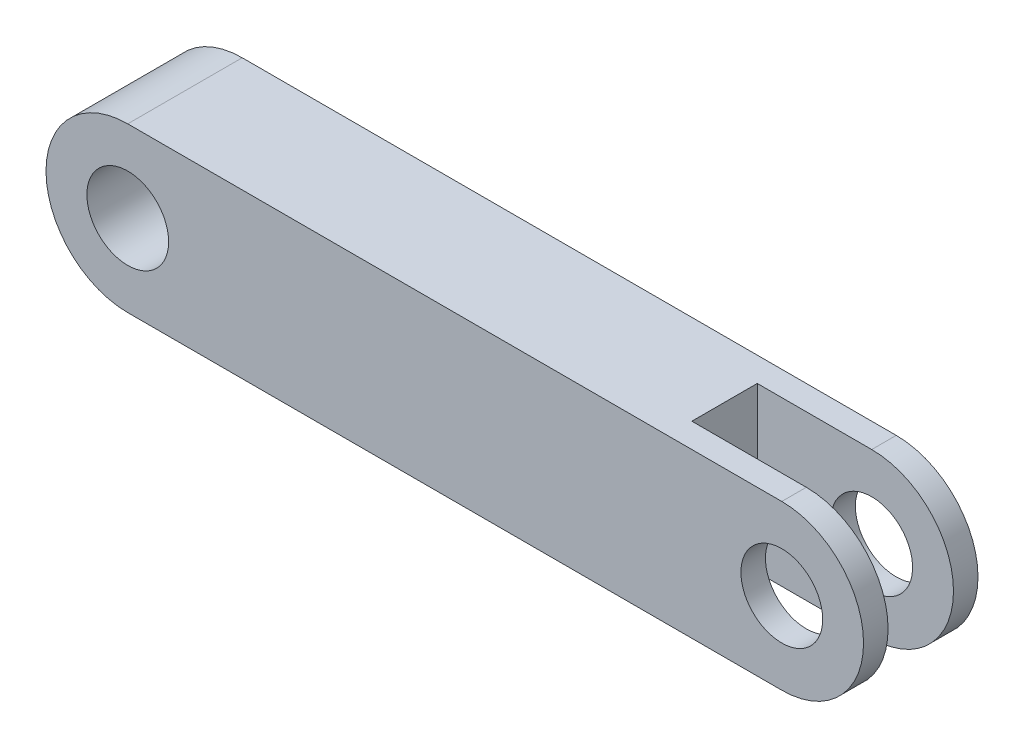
ISO-10303-21;
HEADER;
FILE_DESCRIPTION(('STEP AP214'),'2;1');
FILE_NAME('part.step','',(''),(''),'','','');
FILE_SCHEMA(('AUTOMOTIVE_DESIGN { 1 0 10303 214 1 1 1 1 }'));
ENDSEC;
DATA;
#1=APPLICATION_CONTEXT('core data for automotive mechanical design processes');
#2=APPLICATION_PROTOCOL_DEFINITION('international standard','automotive_design',2000,#1);
#3=PRODUCT_CONTEXT('',#1,'mechanical');
#4=PRODUCT('Part','Part','',(#3));
#5=PRODUCT_RELATED_PRODUCT_CATEGORY('part','',(#4));
#6=PRODUCT_DEFINITION_FORMATION('','',#4);
#7=PRODUCT_DEFINITION_CONTEXT('part definition',#1,'design');
#8=PRODUCT_DEFINITION('design','',#6,#7);
#9=PRODUCT_DEFINITION_SHAPE('','',#8);
#10=(LENGTH_UNIT() NAMED_UNIT(*) SI_UNIT(.MILLI.,.METRE.));
#11=(NAMED_UNIT(*) PLANE_ANGLE_UNIT() SI_UNIT($,.RADIAN.));
#12=(NAMED_UNIT(*) SI_UNIT($,.STERADIAN.) SOLID_ANGLE_UNIT());
#13=UNCERTAINTY_MEASURE_WITH_UNIT(LENGTH_MEASURE(1.E-05),#10,'distance_accuracy_value','');
#14=(GEOMETRIC_REPRESENTATION_CONTEXT(3) GLOBAL_UNCERTAINTY_ASSIGNED_CONTEXT((#13)) GLOBAL_UNIT_ASSIGNED_CONTEXT((#10,
#11,#12)) REPRESENTATION_CONTEXT('',''));
#15=CARTESIAN_POINT('',(0.,0.,0.));
#16=DIRECTION('',(0.,0.,1.));
#17=DIRECTION('',(1.,0.,0.));
#18=AXIS2_PLACEMENT_3D('',#15,#16,#17);
#19=CARTESIAN_POINT('',(40.,-5.,3.5));
#20=DIRECTION('',(0.,0.,-1.));
#21=DIRECTION('',(-1.,0.,0.));
#22=AXIS2_PLACEMENT_3D('',#19,#20,#21);
#23=CYLINDRICAL_SURFACE('',#22,5.);
#24=DIRECTION('',(0.,0.,-1.));
#25=VECTOR('',#24,1.);
#26=CARTESIAN_POINT('',(40.,-9.99999999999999,3.5));
#27=LINE('',#26,#25);
#28=CARTESIAN_POINT('',(40.,-9.99999999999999,3.5));
#29=VERTEX_POINT('',#28);
#30=CARTESIAN_POINT('',(40.,-9.99999999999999,2.));
#31=VERTEX_POINT('',#30);
#32=EDGE_CURVE('E41',#29,#31,#27,.T.);
#33=ORIENTED_EDGE('',*,*,#32,.T.);
#34=CARTESIAN_POINT('',(40.,-5.,2.));
#35=DIRECTION('',(0.,0.,1.));
#36=DIRECTION('',(1.,0.,0.));
#37=AXIS2_PLACEMENT_3D('',#34,#35,#36);
#38=CIRCLE('',#37,5.);
#39=CARTESIAN_POINT('',(40.,0.,2.));
#40=VERTEX_POINT('',#39);
#41=EDGE_CURVE('E103',#40,#31,#38,.F.);
#42=ORIENTED_EDGE('',*,*,#41,.F.);
#43=DIRECTION('',(0.,0.,-1.));
#44=VECTOR('',#43,1.);
#45=CARTESIAN_POINT('',(40.,0.,3.5));
#46=LINE('',#45,#44);
#47=CARTESIAN_POINT('',(40.,0.,3.5));
#48=VERTEX_POINT('',#47);
#49=EDGE_CURVE('E117',#48,#40,#46,.T.);
#50=ORIENTED_EDGE('',*,*,#49,.F.);
#51=CARTESIAN_POINT('',(40.,-5.,3.5));
#52=DIRECTION('',(0.,0.,1.));
#53=DIRECTION('',(-1.,0.,0.));
#54=AXIS2_PLACEMENT_3D('',#51,#52,#53);
#55=CIRCLE('',#54,5.);
#56=EDGE_CURVE('E130',#29,#48,#55,.T.);
#57=ORIENTED_EDGE('',*,*,#56,.F.);
#58=EDGE_LOOP('',(#33,#42,#50,#57));
#59=FACE_BOUND('',#58,.T.);
#60=ADVANCED_FACE('F33',(#59),#23,.T.);
#61=CARTESIAN_POINT('',(40.,-5.,3.5));
#62=DIRECTION('',(0.,0.,-1.));
#63=DIRECTION('',(-1.,0.,0.));
#64=AXIS2_PLACEMENT_3D('',#61,#62,#63);
#65=CYLINDRICAL_SURFACE('',#64,2.5);
#66=CARTESIAN_POINT('',(40.,-5.,2.));
#67=DIRECTION('',(0.,0.,1.));
#68=DIRECTION('',(1.,0.,0.));
#69=AXIS2_PLACEMENT_3D('',#66,#67,#68);
#70=CIRCLE('',#69,2.5);
#71=CARTESIAN_POINT('',(42.5,-5.,2.));
#72=VERTEX_POINT('',#71);
#73=EDGE_CURVE('E163',#72,#72,#70,.F.);
#74=ORIENTED_EDGE('',*,*,#73,.T.);
#75=EDGE_LOOP('',(#74));
#76=FACE_BOUND('',#75,.T.);
#77=CARTESIAN_POINT('',(40.,-5.,3.5));
#78=DIRECTION('',(0.,0.,1.));
#79=DIRECTION('',(1.,0.,0.));
#80=AXIS2_PLACEMENT_3D('',#77,#78,#79);
#81=CIRCLE('',#80,2.5);
#82=CARTESIAN_POINT('',(42.5,-5.,3.5));
#83=VERTEX_POINT('',#82);
#84=EDGE_CURVE('E153',#83,#83,#81,.T.);
#85=ORIENTED_EDGE('',*,*,#84,.T.);
#86=EDGE_LOOP('',(#85));
#87=FACE_BOUND('',#86,.T.);
#88=ADVANCED_FACE('F178',(#76,#87),#65,.F.);
#89=CARTESIAN_POINT('',(0.,-5.,3.5));
#90=DIRECTION('',(0.,0.,-1.));
#91=DIRECTION('',(-1.,0.,0.));
#92=AXIS2_PLACEMENT_3D('',#89,#90,#91);
#93=PLANE('',#92);
#94=CARTESIAN_POINT('',(0.,-5.,3.5));
#95=DIRECTION('',(0.,0.,1.));
#96=DIRECTION('',(1.,0.,0.));
#97=AXIS2_PLACEMENT_3D('',#94,#95,#96);
#98=CIRCLE('',#97,2.5);
#99=CARTESIAN_POINT('',(2.5,-5.,3.5));
#100=VERTEX_POINT('',#99);
#101=EDGE_CURVE('E147',#100,#100,#98,.T.);
#102=ORIENTED_EDGE('',*,*,#101,.F.);
#103=EDGE_LOOP('',(#102));
#104=FACE_BOUND('',#103,.T.);
#105=CARTESIAN_POINT('',(0.,-5.,3.5));
#106=DIRECTION('',(0.,0.,1.));
#107=DIRECTION('',(-1.,0.,0.));
#108=AXIS2_PLACEMENT_3D('',#105,#106,#107);
#109=CIRCLE('',#108,5.);
#110=CARTESIAN_POINT('',(0.,0.,3.5));
#111=VERTEX_POINT('',#110);
#112=CARTESIAN_POINT('',(0.,-10.,3.5));
#113=VERTEX_POINT('',#112);
#114=EDGE_CURVE('E134',#111,#113,#109,.T.);
#115=ORIENTED_EDGE('',*,*,#114,.T.);
#116=DIRECTION('',(1.,0.,0.));
#117=VECTOR('',#116,1.);
#118=CARTESIAN_POINT('',(40.,-9.99999999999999,3.5));
#119=LINE('',#118,#117);
#120=EDGE_CURVE('E132',#113,#29,#119,.T.);
#121=ORIENTED_EDGE('',*,*,#120,.T.);
#122=ORIENTED_EDGE('',*,*,#56,.T.);
#123=DIRECTION('',(-1.,0.,0.));
#124=VECTOR('',#123,1.);
#125=CARTESIAN_POINT('',(0.,0.,3.5));
#126=LINE('',#125,#124);
#127=EDGE_CURVE('E56',#48,#111,#126,.T.);
#128=ORIENTED_EDGE('',*,*,#127,.T.);
#129=EDGE_LOOP('',(#115,#121,#122,#128));
#130=FACE_BOUND('',#129,.T.);
#131=ORIENTED_EDGE('',*,*,#84,.F.);
#132=EDGE_LOOP('',(#131));
#133=FACE_BOUND('',#132,.T.);
#134=ADVANCED_FACE('F201',(#104,#130,#133),#93,.F.);
#135=CARTESIAN_POINT('',(0.,-5.,-3.5));
#136=DIRECTION('',(0.,0.,-1.));
#137=DIRECTION('',(-1.,0.,0.));
#138=AXIS2_PLACEMENT_3D('',#135,#136,#137);
#139=PLANE('',#138);
#140=CARTESIAN_POINT('',(0.,-5.,-3.5));
#141=DIRECTION('',(0.,0.,1.));
#142=DIRECTION('',(1.,0.,0.));
#143=AXIS2_PLACEMENT_3D('',#140,#141,#142);
#144=CIRCLE('',#143,2.5);
#145=CARTESIAN_POINT('',(2.5,-5.,-3.5));
#146=VERTEX_POINT('',#145);
#147=EDGE_CURVE('E150',#146,#146,#144,.T.);
#148=ORIENTED_EDGE('',*,*,#147,.T.);
#149=EDGE_LOOP('',(#148));
#150=FACE_BOUND('',#149,.T.);
#151=CARTESIAN_POINT('',(0.,-5.,-3.5));
#152=DIRECTION('',(0.,0.,1.));
#153=DIRECTION('',(-1.,0.,0.));
#154=AXIS2_PLACEMENT_3D('',#151,#152,#153);
#155=CIRCLE('',#154,5.);
#156=CARTESIAN_POINT('',(0.,0.,-3.5));
#157=VERTEX_POINT('',#156);
#158=CARTESIAN_POINT('',(0.,-10.,-3.5));
#159=VERTEX_POINT('',#158);
#160=EDGE_CURVE('E144',#157,#159,#155,.T.);
#161=ORIENTED_EDGE('',*,*,#160,.F.);
#162=DIRECTION('',(-1.,0.,0.));
#163=VECTOR('',#162,1.);
#164=CARTESIAN_POINT('',(0.,0.,-3.5));
#165=LINE('',#164,#163);
#166=CARTESIAN_POINT('',(40.,0.,-3.5));
#167=VERTEX_POINT('',#166);
#168=EDGE_CURVE('E136',#167,#157,#165,.T.);
#169=ORIENTED_EDGE('',*,*,#168,.F.);
#170=CARTESIAN_POINT('',(40.,-5.,-3.5));
#171=DIRECTION('',(0.,0.,1.));
#172=DIRECTION('',(-1.,0.,0.));
#173=AXIS2_PLACEMENT_3D('',#170,#171,#172);
#174=CIRCLE('',#173,5.);
#175=CARTESIAN_POINT('',(40.,-9.99999999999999,-3.5));
#176=VERTEX_POINT('',#175);
#177=EDGE_CURVE('E138',#176,#167,#174,.T.);
#178=ORIENTED_EDGE('',*,*,#177,.F.);
#179=DIRECTION('',(1.,0.,0.));
#180=VECTOR('',#179,1.);
#181=CARTESIAN_POINT('',(40.,-9.99999999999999,-3.5));
#182=LINE('',#181,#180);
#183=EDGE_CURVE('E141',#159,#176,#182,.T.);
#184=ORIENTED_EDGE('',*,*,#183,.F.);
#185=EDGE_LOOP('',(#161,#169,#178,#184));
#186=FACE_BOUND('',#185,.T.);
#187=CARTESIAN_POINT('',(40.,-5.,-3.5));
#188=DIRECTION('',(0.,0.,1.));
#189=DIRECTION('',(1.,0.,0.));
#190=AXIS2_PLACEMENT_3D('',#187,#188,#189);
#191=CIRCLE('',#190,2.5);
#192=CARTESIAN_POINT('',(42.5,-5.,-3.5));
#193=VERTEX_POINT('',#192);
#194=EDGE_CURVE('E156',#193,#193,#191,.T.);
#195=ORIENTED_EDGE('',*,*,#194,.T.);
#196=EDGE_LOOP('',(#195));
#197=FACE_BOUND('',#196,.T.);
#198=ADVANCED_FACE('F220',(#150,#186,#197),#139,.T.);
#199=CARTESIAN_POINT('',(0.,-5.,3.5));
#200=DIRECTION('',(0.,0.,-1.));
#201=DIRECTION('',(-1.,0.,0.));
#202=AXIS2_PLACEMENT_3D('',#199,#200,#201);
#203=CYLINDRICAL_SURFACE('',#202,5.);
#204=ORIENTED_EDGE('',*,*,#160,.T.);
#205=DIRECTION('',(0.,0.,-1.));
#206=VECTOR('',#205,1.);
#207=CARTESIAN_POINT('',(0.,-10.,3.5));
#208=LINE('',#207,#206);
#209=EDGE_CURVE('E11',#113,#159,#208,.T.);
#210=ORIENTED_EDGE('',*,*,#209,.F.);
#211=ORIENTED_EDGE('',*,*,#114,.F.);
#212=DIRECTION('',(0.,0.,-1.));
#213=VECTOR('',#212,1.);
#214=CARTESIAN_POINT('',(0.,0.,3.5));
#215=LINE('',#214,#213);
#216=EDGE_CURVE('E125',#111,#157,#215,.T.);
#217=ORIENTED_EDGE('',*,*,#216,.T.);
#218=EDGE_LOOP('',(#204,#210,#211,#217));
#219=FACE_BOUND('',#218,.T.);
#220=ADVANCED_FACE('F35',(#219),#203,.T.);
#221=CARTESIAN_POINT('',(40.,-9.99999999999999,3.5));
#222=DIRECTION('',(0.,1.,0.));
#223=DIRECTION('',(-1.,0.,0.));
#224=AXIS2_PLACEMENT_3D('',#221,#222,#223);
#225=PLANE('',#224);
#226=DIRECTION('',(0.,0.,-1.));
#227=VECTOR('',#226,1.);
#228=CARTESIAN_POINT('',(33.,-9.99999999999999,-2.));
#229=LINE('',#228,#227);
#230=CARTESIAN_POINT('',(33.,-9.99999999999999,2.));
#231=VERTEX_POINT('',#230);
#232=CARTESIAN_POINT('',(33.,-9.99999999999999,-2.));
#233=VERTEX_POINT('',#232);
#234=EDGE_CURVE('E171',#231,#233,#229,.T.);
#235=ORIENTED_EDGE('',*,*,#234,.F.);
#236=DIRECTION('',(-1.,0.,0.));
#237=VECTOR('',#236,1.);
#238=CARTESIAN_POINT('',(45.,-9.99999999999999,2.));
#239=LINE('',#238,#237);
#240=EDGE_CURVE('E169',#31,#231,#239,.T.);
#241=ORIENTED_EDGE('',*,*,#240,.F.);
#242=ORIENTED_EDGE('',*,*,#32,.F.);
#243=ORIENTED_EDGE('',*,*,#120,.F.);
#244=ORIENTED_EDGE('',*,*,#209,.T.);
#245=ORIENTED_EDGE('',*,*,#183,.T.);
#246=CARTESIAN_POINT('',(40.,-9.99999999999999,-2.));
#247=VERTEX_POINT('',#246);
#248=EDGE_CURVE('E122',#247,#176,#27,.T.);
#249=ORIENTED_EDGE('',*,*,#248,.F.);
#250=DIRECTION('',(1.,0.,0.));
#251=VECTOR('',#250,1.);
#252=CARTESIAN_POINT('',(45.,-9.99999999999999,-2.));
#253=LINE('',#252,#251);
#254=EDGE_CURVE('E159',#233,#247,#253,.T.);
#255=ORIENTED_EDGE('',*,*,#254,.F.);
#256=EDGE_LOOP('',(#235,#241,#242,#243,#244,#245,#249,#255));
#257=FACE_BOUND('',#256,.T.);
#258=ADVANCED_FACE('F204',(#257),#225,.F.);
#259=CARTESIAN_POINT('',(40.,0.,-2.));
#260=VERTEX_POINT('',#259);
#261=EDGE_CURVE('E123',#260,#167,#46,.T.);
#262=ORIENTED_EDGE('',*,*,#261,.F.);
#263=CARTESIAN_POINT('',(40.,-5.,-2.));
#264=DIRECTION('',(0.,0.,-1.));
#265=DIRECTION('',(-1.,0.,0.));
#266=AXIS2_PLACEMENT_3D('',#263,#264,#265);
#267=CIRCLE('',#266,5.);
#268=EDGE_CURVE('E48',#247,#260,#267,.F.);
#269=ORIENTED_EDGE('',*,*,#268,.F.);
#270=ORIENTED_EDGE('',*,*,#248,.T.);
#271=ORIENTED_EDGE('',*,*,#177,.T.);
#272=EDGE_LOOP('',(#262,#269,#270,#271));
#273=FACE_BOUND('',#272,.T.);
#274=ADVANCED_FACE('F197',(#273),#23,.T.);
#275=CARTESIAN_POINT('',(0.,0.,3.5));
#276=DIRECTION('',(0.,-1.,0.));
#277=DIRECTION('',(0.,0.,-1.));
#278=AXIS2_PLACEMENT_3D('',#275,#276,#277);
#279=PLANE('',#278);
#280=ORIENTED_EDGE('',*,*,#49,.T.);
#281=DIRECTION('',(1.,0.,0.));
#282=VECTOR('',#281,1.);
#283=CARTESIAN_POINT('',(45.,0.,2.));
#284=LINE('',#283,#282);
#285=CARTESIAN_POINT('',(33.,0.,2.));
#286=VERTEX_POINT('',#285);
#287=EDGE_CURVE('E99',#286,#40,#284,.T.);
#288=ORIENTED_EDGE('',*,*,#287,.F.);
#289=DIRECTION('',(0.,0.,1.));
#290=VECTOR('',#289,1.);
#291=CARTESIAN_POINT('',(33.,0.,-2.));
#292=LINE('',#291,#290);
#293=CARTESIAN_POINT('',(33.,0.,-2.));
#294=VERTEX_POINT('',#293);
#295=EDGE_CURVE('E111',#294,#286,#292,.T.);
#296=ORIENTED_EDGE('',*,*,#295,.F.);
#297=DIRECTION('',(-1.,0.,0.));
#298=VECTOR('',#297,1.);
#299=CARTESIAN_POINT('',(45.,0.,-2.));
#300=LINE('',#299,#298);
#301=EDGE_CURVE('E167',#260,#294,#300,.T.);
#302=ORIENTED_EDGE('',*,*,#301,.F.);
#303=ORIENTED_EDGE('',*,*,#261,.T.);
#304=ORIENTED_EDGE('',*,*,#168,.T.);
#305=ORIENTED_EDGE('',*,*,#216,.F.);
#306=ORIENTED_EDGE('',*,*,#127,.F.);
#307=EDGE_LOOP('',(#280,#288,#296,#302,#303,#304,#305,#306));
#308=FACE_BOUND('',#307,.T.);
#309=ADVANCED_FACE('F121',(#308),#279,.F.);
#310=CARTESIAN_POINT('',(0.,-5.,3.5));
#311=DIRECTION('',(0.,0.,-1.));
#312=DIRECTION('',(-1.,0.,0.));
#313=AXIS2_PLACEMENT_3D('',#310,#311,#312);
#314=CYLINDRICAL_SURFACE('',#313,2.5);
#315=ORIENTED_EDGE('',*,*,#101,.T.);
#316=EDGE_LOOP('',(#315));
#317=FACE_BOUND('',#316,.T.);
#318=ORIENTED_EDGE('',*,*,#147,.F.);
#319=EDGE_LOOP('',(#318));
#320=FACE_BOUND('',#319,.T.);
#321=ADVANCED_FACE('F192',(#317,#320),#314,.F.);
#322=CARTESIAN_POINT('',(40.,-5.,-2.));
#323=DIRECTION('',(0.,0.,-1.));
#324=DIRECTION('',(-1.,0.,0.));
#325=AXIS2_PLACEMENT_3D('',#322,#323,#324);
#326=CIRCLE('',#325,2.5);
#327=CARTESIAN_POINT('',(37.5,-5.,-2.));
#328=VERTEX_POINT('',#327);
#329=EDGE_CURVE('E119',#328,#328,#326,.F.);
#330=ORIENTED_EDGE('',*,*,#329,.T.);
#331=EDGE_LOOP('',(#330));
#332=FACE_BOUND('',#331,.T.);
#333=ORIENTED_EDGE('',*,*,#194,.F.);
#334=EDGE_LOOP('',(#333));
#335=FACE_BOUND('',#334,.T.);
#336=ADVANCED_FACE('F183',(#332,#335),#65,.F.);
#337=CARTESIAN_POINT('',(45.,-10.001,2.));
#338=DIRECTION('',(0.,0.,1.));
#339=DIRECTION('',(1.,0.,0.));
#340=AXIS2_PLACEMENT_3D('',#337,#338,#339);
#341=PLANE('',#340);
#342=ORIENTED_EDGE('',*,*,#73,.F.);
#343=EDGE_LOOP('',(#342));
#344=FACE_BOUND('',#343,.T.);
#345=ORIENTED_EDGE('',*,*,#240,.T.);
#346=DIRECTION('',(0.,1.,0.));
#347=VECTOR('',#346,1.);
#348=CARTESIAN_POINT('',(33.,-10.001,2.));
#349=LINE('',#348,#347);
#350=EDGE_CURVE('E105',#231,#286,#349,.T.);
#351=ORIENTED_EDGE('',*,*,#350,.T.);
#352=ORIENTED_EDGE('',*,*,#287,.T.);
#353=ORIENTED_EDGE('',*,*,#41,.T.);
#354=EDGE_LOOP('',(#345,#351,#352,#353));
#355=FACE_BOUND('',#354,.T.);
#356=ADVANCED_FACE('F102',(#344,#355),#341,.F.);
#357=CARTESIAN_POINT('',(33.,-10.001,-2.));
#358=DIRECTION('',(-1.,0.,0.));
#359=DIRECTION('',(0.,0.,1.));
#360=AXIS2_PLACEMENT_3D('',#357,#358,#359);
#361=PLANE('',#360);
#362=ORIENTED_EDGE('',*,*,#234,.T.);
#363=DIRECTION('',(0.,1.,0.));
#364=VECTOR('',#363,1.);
#365=CARTESIAN_POINT('',(33.,-10.001,-2.));
#366=LINE('',#365,#364);
#367=EDGE_CURVE('E110',#233,#294,#366,.T.);
#368=ORIENTED_EDGE('',*,*,#367,.T.);
#369=ORIENTED_EDGE('',*,*,#295,.T.);
#370=ORIENTED_EDGE('',*,*,#350,.F.);
#371=EDGE_LOOP('',(#362,#368,#369,#370));
#372=FACE_BOUND('',#371,.T.);
#373=ADVANCED_FACE('F182',(#372),#361,.F.);
#374=CARTESIAN_POINT('',(45.,-10.001,-2.));
#375=DIRECTION('',(0.,0.,-1.));
#376=DIRECTION('',(-1.,0.,0.));
#377=AXIS2_PLACEMENT_3D('',#374,#375,#376);
#378=PLANE('',#377);
#379=ORIENTED_EDGE('',*,*,#329,.F.);
#380=EDGE_LOOP('',(#379));
#381=FACE_BOUND('',#380,.T.);
#382=ORIENTED_EDGE('',*,*,#254,.T.);
#383=ORIENTED_EDGE('',*,*,#268,.T.);
#384=ORIENTED_EDGE('',*,*,#301,.T.);
#385=ORIENTED_EDGE('',*,*,#367,.F.);
#386=EDGE_LOOP('',(#382,#383,#384,#385));
#387=FACE_BOUND('',#386,.T.);
#388=ADVANCED_FACE('F189',(#381,#387),#378,.F.);
#389=CLOSED_SHELL('',(#60,#88,#134,#198,#220,#258,#274,#309,#321,#336,#356,#373,#388));
#390=MANIFOLD_SOLID_BREP('B2',#389);
#391=ADVANCED_BREP_SHAPE_REPRESENTATION('',(#18,#390),#14);
#392=SHAPE_DEFINITION_REPRESENTATION(#9,#391);
ENDSEC;
END-ISO-10303-21;
